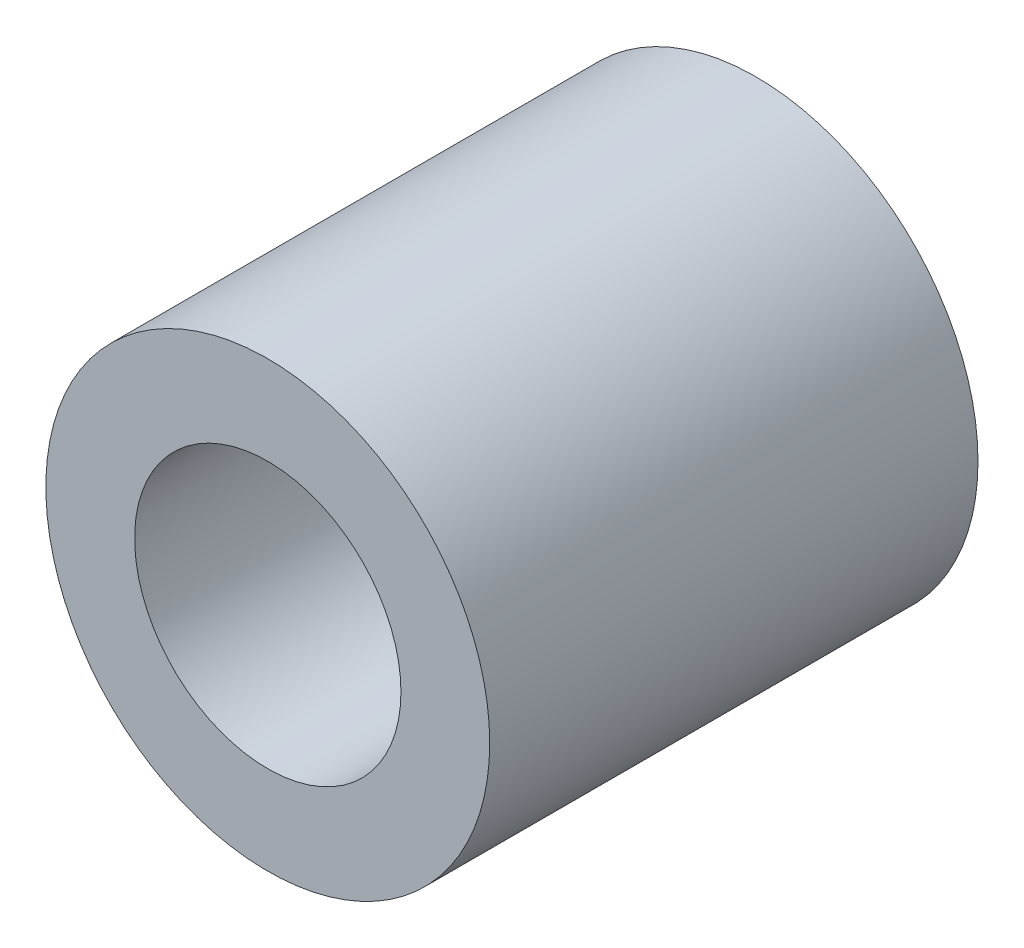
ISO-10303-21;
HEADER;
FILE_DESCRIPTION(('STEP AP214'),'2;1');
FILE_NAME('part.step','',(''),(''),'','','');
FILE_SCHEMA(('AUTOMOTIVE_DESIGN { 1 0 10303 214 1 1 1 1 }'));
ENDSEC;
DATA;
#1=APPLICATION_CONTEXT('core data for automotive mechanical design processes');
#2=APPLICATION_PROTOCOL_DEFINITION('international standard','automotive_design',2000,#1);
#3=PRODUCT_CONTEXT('',#1,'mechanical');
#4=PRODUCT('Part','Part','',(#3));
#5=PRODUCT_RELATED_PRODUCT_CATEGORY('part','',(#4));
#6=PRODUCT_DEFINITION_FORMATION('','',#4);
#7=PRODUCT_DEFINITION_CONTEXT('part definition',#1,'design');
#8=PRODUCT_DEFINITION('design','',#6,#7);
#9=PRODUCT_DEFINITION_SHAPE('','',#8);
#10=(LENGTH_UNIT() NAMED_UNIT(*) SI_UNIT(.MILLI.,.METRE.));
#11=(NAMED_UNIT(*) PLANE_ANGLE_UNIT() SI_UNIT($,.RADIAN.));
#12=(NAMED_UNIT(*) SI_UNIT($,.STERADIAN.) SOLID_ANGLE_UNIT());
#13=UNCERTAINTY_MEASURE_WITH_UNIT(LENGTH_MEASURE(1.E-05),#10,'distance_accuracy_value','');
#14=(GEOMETRIC_REPRESENTATION_CONTEXT(3) GLOBAL_UNCERTAINTY_ASSIGNED_CONTEXT((#13)) GLOBAL_UNIT_ASSIGNED_CONTEXT((#10,
#11,#12)) REPRESENTATION_CONTEXT('',''));
#15=CARTESIAN_POINT('',(0.,0.,0.));
#16=DIRECTION('',(0.,0.,1.));
#17=DIRECTION('',(1.,0.,0.));
#18=AXIS2_PLACEMENT_3D('',#15,#16,#17);
#19=CARTESIAN_POINT('',(0.,0.,11.));
#20=DIRECTION('',(0.,0.,1.));
#21=DIRECTION('',(1.,0.,0.));
#22=AXIS2_PLACEMENT_3D('',#19,#20,#21);
#23=PLANE('',#22);
#24=CARTESIAN_POINT('',(0.,0.,11.));
#25=DIRECTION('',(0.,0.,1.));
#26=DIRECTION('',(1.,0.,0.));
#27=AXIS2_PLACEMENT_3D('',#24,#25,#26);
#28=CIRCLE('',#27,5.);
#29=CARTESIAN_POINT('',(5.,0.,11.));
#30=VERTEX_POINT('',#29);
#31=EDGE_CURVE('E10',#30,#30,#28,.T.);
#32=ORIENTED_EDGE('',*,*,#31,.T.);
#33=EDGE_LOOP('',(#32));
#34=FACE_BOUND('',#33,.T.);
#35=CARTESIAN_POINT('',(0.,0.,11.));
#36=DIRECTION('',(0.,0.,1.));
#37=DIRECTION('',(1.,0.,0.));
#38=AXIS2_PLACEMENT_3D('',#35,#36,#37);
#39=CIRCLE('',#38,3.);
#40=CARTESIAN_POINT('',(3.,0.,11.));
#41=VERTEX_POINT('',#40);
#42=EDGE_CURVE('E40',#41,#41,#39,.T.);
#43=ORIENTED_EDGE('',*,*,#42,.F.);
#44=EDGE_LOOP('',(#43));
#45=FACE_BOUND('',#44,.T.);
#46=ADVANCED_FACE('F29',(#34,#45),#23,.T.);
#47=CARTESIAN_POINT('',(0.,0.,0.));
#48=DIRECTION('',(0.,0.,1.));
#49=DIRECTION('',(1.,0.,0.));
#50=AXIS2_PLACEMENT_3D('',#47,#48,#49);
#51=PLANE('',#50);
#52=CARTESIAN_POINT('',(0.,0.,0.));
#53=DIRECTION('',(0.,0.,1.));
#54=DIRECTION('',(1.,0.,0.));
#55=AXIS2_PLACEMENT_3D('',#52,#53,#54);
#56=CIRCLE('',#55,5.);
#57=CARTESIAN_POINT('',(5.,0.,0.));
#58=VERTEX_POINT('',#57);
#59=EDGE_CURVE('E33',#58,#58,#56,.T.);
#60=ORIENTED_EDGE('',*,*,#59,.F.);
#61=EDGE_LOOP('',(#60));
#62=FACE_BOUND('',#61,.T.);
#63=CARTESIAN_POINT('',(0.,0.,0.));
#64=DIRECTION('',(0.,0.,1.));
#65=DIRECTION('',(1.,0.,0.));
#66=AXIS2_PLACEMENT_3D('',#63,#64,#65);
#67=CIRCLE('',#66,3.);
#68=CARTESIAN_POINT('',(3.,0.,0.));
#69=VERTEX_POINT('',#68);
#70=EDGE_CURVE('E42',#69,#69,#67,.T.);
#71=ORIENTED_EDGE('',*,*,#70,.T.);
#72=EDGE_LOOP('',(#71));
#73=FACE_BOUND('',#72,.T.);
#74=ADVANCED_FACE('F52',(#62,#73),#51,.F.);
#75=CARTESIAN_POINT('',(0.,0.,11.));
#76=DIRECTION('',(0.,0.,-1.));
#77=DIRECTION('',(-1.,0.,0.));
#78=AXIS2_PLACEMENT_3D('',#75,#76,#77);
#79=CYLINDRICAL_SURFACE('',#78,5.);
#80=ORIENTED_EDGE('',*,*,#31,.F.);
#81=EDGE_LOOP('',(#80));
#82=FACE_BOUND('',#81,.T.);
#83=ORIENTED_EDGE('',*,*,#59,.T.);
#84=EDGE_LOOP('',(#83));
#85=FACE_BOUND('',#84,.T.);
#86=ADVANCED_FACE('F31',(#82,#85),#79,.T.);
#87=CARTESIAN_POINT('',(0.,0.,11.));
#88=DIRECTION('',(0.,0.,-1.));
#89=DIRECTION('',(-1.,0.,0.));
#90=AXIS2_PLACEMENT_3D('',#87,#88,#89);
#91=CYLINDRICAL_SURFACE('',#90,3.);
#92=ORIENTED_EDGE('',*,*,#42,.T.);
#93=EDGE_LOOP('',(#92));
#94=FACE_BOUND('',#93,.T.);
#95=ORIENTED_EDGE('',*,*,#70,.F.);
#96=EDGE_LOOP('',(#95));
#97=FACE_BOUND('',#96,.T.);
#98=ADVANCED_FACE('F48',(#94,#97),#91,.F.);
#99=CLOSED_SHELL('',(#46,#74,#86,#98));
#100=MANIFOLD_SOLID_BREP('B2',#99);
#101=ADVANCED_BREP_SHAPE_REPRESENTATION('',(#18,#100),#14);
#102=SHAPE_DEFINITION_REPRESENTATION(#9,#101);
ENDSEC;
END-ISO-10303-21;
